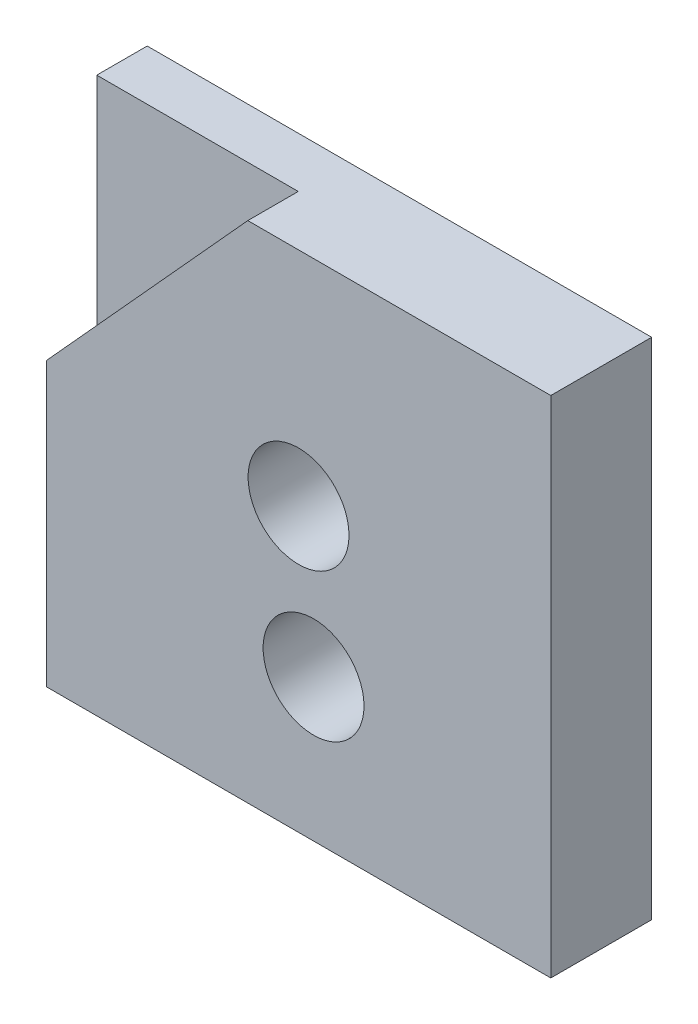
from build123d import *

# Parameters (mm, degrees)
ESQUISSE1_W             = 50
ESQUISSE1_H             = 50
ESQUISSE1_R             = 5
BOSS_EXTRU_1_DEPTH      = 10
ENL_V_MAT_EXTRU_1_DEPTH = 5
ESQUISSE3_R             = 5
ENL_V_MAT_EXTRU_2_DEPTH = 72.414284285


with BuildPart() as part:
    # Esquisse1 → Boss.-Extru.1 (new body)
    with BuildSketch(Plane.XY):
        with Locations((-25, 25)):
            Rectangle(ESQUISSE1_W, ESQUISSE1_H)
        with Locations((-23.511572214, 14.084146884)):
            Circle(ESQUISSE1_R, mode=Mode.SUBTRACT)
    extrude(amount=BOSS_EXTRU_1_DEPTH)

    # Esquisse2 → Enl_v. mat.-Extru.1 (cut)
    with BuildSketch(Plane.XY.offset(10)):
        Polygon((-50, 28), (-30.03, 50), (-50, 50), align=None)
    extrude(amount=-ENL_V_MAT_EXTRU_1_DEPTH, mode=Mode.SUBTRACT)

    # Esquisse3 → Enl_v. mat.-Extru.2 (cut, through all)
    with BuildSketch(Plane.XY.offset(10)):
        with Locations((-25, 28)):
            Circle(ESQUISSE3_R)
    extrude(amount=-ENL_V_MAT_EXTRU_2_DEPTH, mode=Mode.SUBTRACT)


solid = part.part
